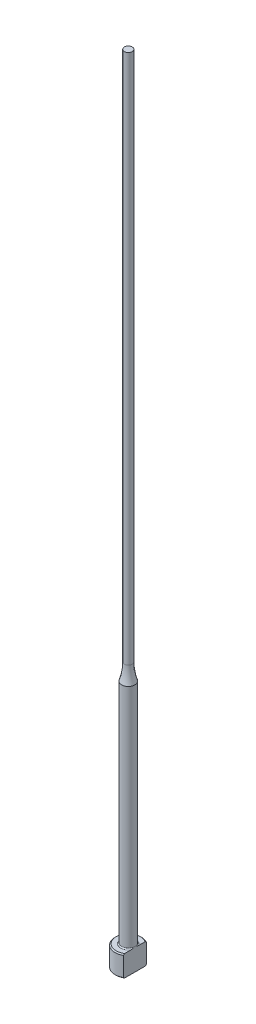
from build123d import *
from build123d.topology import SkipClean

# Parameters (mm, degrees)
CHAMFER1_SIZE    = 0.2
FILLET1_R        = 0.2
KEYED_HEAD_DEPTH = 151.041660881


with BuildPart() as part:
    # Sketch1 → Revolve1 (revolve)
    with BuildSketch(Plane.XY, mode=Mode.PRIVATE) as revolve1_sk:
        with BuildLine():
            Line((0, 0), (-2.5, 0))
            Line((-2.5, 0), (-2.5, 4))
            Line((-2.5, 4), (-1.25, 4))
            Line((-1.25, 4), (-1.25, 46.877501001))
            ThreePointArc((-1.25, 46.877501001), (-0.875791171, 48.41886117), (-0.75, 50))
            Line((-0.75, 50), (-0.75, 150))
            Line((-0.75, 150), (0, 150))
            Line((0, 150), (0, 0))
        make_face()
    revolve(revolve1_sk.sketch.rotate(Axis((0, 259.958771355, 0), (0, -1, 0)), 270), axis=Axis((0, 259.958771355, 0), (0, -1, 0)))

    # Chamfer1
    chamfer1_edges = [part.edges().sort_by_distance(p)[0] for p in [
        (0, 0, -2.5),
        (0, 4, -2.5),
    ]]
    chamfer(chamfer1_edges, length=CHAMFER1_SIZE)

    # Fillet1
    fillet1_edges = [part.edges().sort_by_distance(p)[0] for p in [
        (0, 4, -1.25),
    ]]
    fillet(fillet1_edges, radius=FILLET1_R)

    # Sketch2 → Keyed Head (cut, through all)
    with SkipClean():  # the faces are left unmerged after this step: merging them gives an invalid solid
        with BuildSketch(Plane(origin=(0, 0, 0), x_dir=(1, 0, 0), z_dir=(0, 1, 0))):
            with BuildLine():
                Line((1.25, -2.165063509), (1.25, 2.165063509))
                ThreePointArc((1.25, 2.165063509), (2.5, 0), (1.25, -2.165063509))
            make_face()
        extrude(amount=KEYED_HEAD_DEPTH, mode=Mode.SUBTRACT)


solid = part.part
